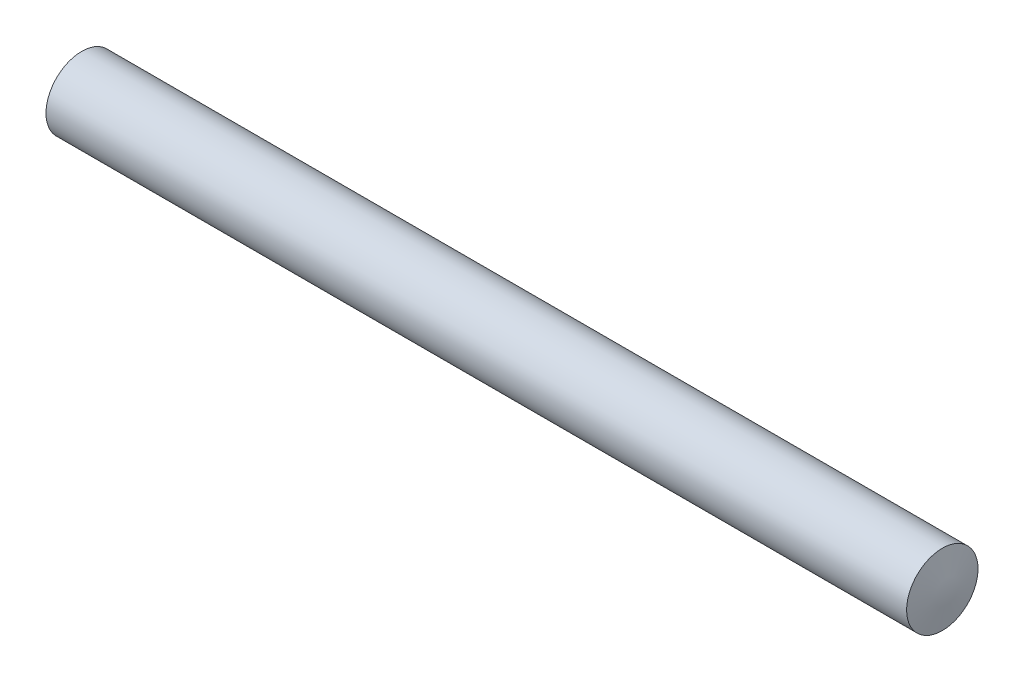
ISO-10303-21;
HEADER;
FILE_DESCRIPTION(('STEP AP214'),'2;1');
FILE_NAME('part.step','',(''),(''),'','','');
FILE_SCHEMA(('AUTOMOTIVE_DESIGN { 1 0 10303 214 1 1 1 1 }'));
ENDSEC;
DATA;
#1=APPLICATION_CONTEXT('core data for automotive mechanical design processes');
#2=APPLICATION_PROTOCOL_DEFINITION('international standard','automotive_design',2000,#1);
#3=PRODUCT_CONTEXT('',#1,'mechanical');
#4=PRODUCT('Part','Part','',(#3));
#5=PRODUCT_RELATED_PRODUCT_CATEGORY('part','',(#4));
#6=PRODUCT_DEFINITION_FORMATION('','',#4);
#7=PRODUCT_DEFINITION_CONTEXT('part definition',#1,'design');
#8=PRODUCT_DEFINITION('design','',#6,#7);
#9=PRODUCT_DEFINITION_SHAPE('','',#8);
#10=(LENGTH_UNIT() NAMED_UNIT(*) SI_UNIT(.MILLI.,.METRE.));
#11=(NAMED_UNIT(*) PLANE_ANGLE_UNIT() SI_UNIT($,.RADIAN.));
#12=(NAMED_UNIT(*) SI_UNIT($,.STERADIAN.) SOLID_ANGLE_UNIT());
#13=UNCERTAINTY_MEASURE_WITH_UNIT(LENGTH_MEASURE(1.E-05),#10,'distance_accuracy_value','');
#14=(GEOMETRIC_REPRESENTATION_CONTEXT(3) GLOBAL_UNCERTAINTY_ASSIGNED_CONTEXT((#13)) GLOBAL_UNIT_ASSIGNED_CONTEXT((#10,
#11,#12)) REPRESENTATION_CONTEXT('',''));
#15=CARTESIAN_POINT('',(0.,0.,0.));
#16=DIRECTION('',(0.,0.,1.));
#17=DIRECTION('',(1.,0.,0.));
#18=AXIS2_PLACEMENT_3D('',#15,#16,#17);
#19=CARTESIAN_POINT('',(15.5286363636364,-25.4,0.));
#20=DIRECTION('',(-1.,0.,0.));
#21=DIRECTION('',(0.,0.,1.));
#22=AXIS2_PLACEMENT_3D('',#19,#20,#21);
#23=CONICAL_SURFACE('',#22,0.,1.39975670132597);
#24=CARTESIAN_POINT('',(15.3092727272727,-25.4,0.));
#25=DIRECTION('',(1.,0.,0.));
#26=DIRECTION('',(0.,0.,-1.));
#27=AXIS2_PLACEMENT_3D('',#24,#25,#26);
#28=CIRCLE('',#27,1.27);
#29=CARTESIAN_POINT('',(15.3092727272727,-25.4,-1.27));
#30=VERTEX_POINT('',#29);
#31=EDGE_CURVE('E11',#30,#30,#28,.T.);
#32=ORIENTED_EDGE('',*,*,#31,.T.);
#33=EDGE_LOOP('',(#32));
#34=FACE_BOUND('',#33,.T.);
#35=CARTESIAN_POINT('',(15.5286363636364,-25.4,0.));
#36=VERTEX_POINT('',#35);
#37=VERTEX_LOOP('',#36);
#38=FACE_BOUND('',#37,.T.);
#39=ADVANCED_FACE('F30',(#34,#38),#23,.T.);
#40=CARTESIAN_POINT('',(15.5286363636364,-25.4,0.));
#41=DIRECTION('',(1.,0.,0.));
#42=DIRECTION('',(0.,0.,-1.));
#43=AXIS2_PLACEMENT_3D('',#40,#41,#42);
#44=CYLINDRICAL_SURFACE('',#43,1.27);
#45=ORIENTED_EDGE('',*,*,#31,.F.);
#46=EDGE_LOOP('',(#45));
#47=FACE_BOUND('',#46,.T.);
#48=CARTESIAN_POINT('',(-15.3092727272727,-25.4,0.));
#49=DIRECTION('',(1.,0.,0.));
#50=DIRECTION('',(0.,0.,-1.));
#51=AXIS2_PLACEMENT_3D('',#48,#49,#50);
#52=CIRCLE('',#51,1.27);
#53=CARTESIAN_POINT('',(-15.3092727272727,-25.4,-1.27));
#54=VERTEX_POINT('',#53);
#55=EDGE_CURVE('E37',#54,#54,#52,.T.);
#56=ORIENTED_EDGE('',*,*,#55,.T.);
#57=EDGE_LOOP('',(#56));
#58=FACE_BOUND('',#57,.T.);
#59=ADVANCED_FACE('F45',(#47,#58),#44,.T.);
#60=CARTESIAN_POINT('',(-15.5286363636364,-25.4,0.));
#61=DIRECTION('',(1.,0.,0.));
#62=DIRECTION('',(0.,0.,1.));
#63=AXIS2_PLACEMENT_3D('',#60,#61,#62);
#64=CONICAL_SURFACE('',#63,0.,1.39975670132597);
#65=ORIENTED_EDGE('',*,*,#55,.F.);
#66=EDGE_LOOP('',(#65));
#67=FACE_BOUND('',#66,.T.);
#68=CARTESIAN_POINT('',(-15.5286363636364,-25.4,0.));
#69=VERTEX_POINT('',#68);
#70=VERTEX_LOOP('',#69);
#71=FACE_BOUND('',#70,.T.);
#72=ADVANCED_FACE('F43',(#67,#71),#64,.T.);
#73=CLOSED_SHELL('',(#39,#59,#72));
#74=MANIFOLD_SOLID_BREP('B2',#73);
#75=ADVANCED_BREP_SHAPE_REPRESENTATION('',(#18,#74),#14);
#76=SHAPE_DEFINITION_REPRESENTATION(#9,#75);
ENDSEC;
END-ISO-10303-21;
